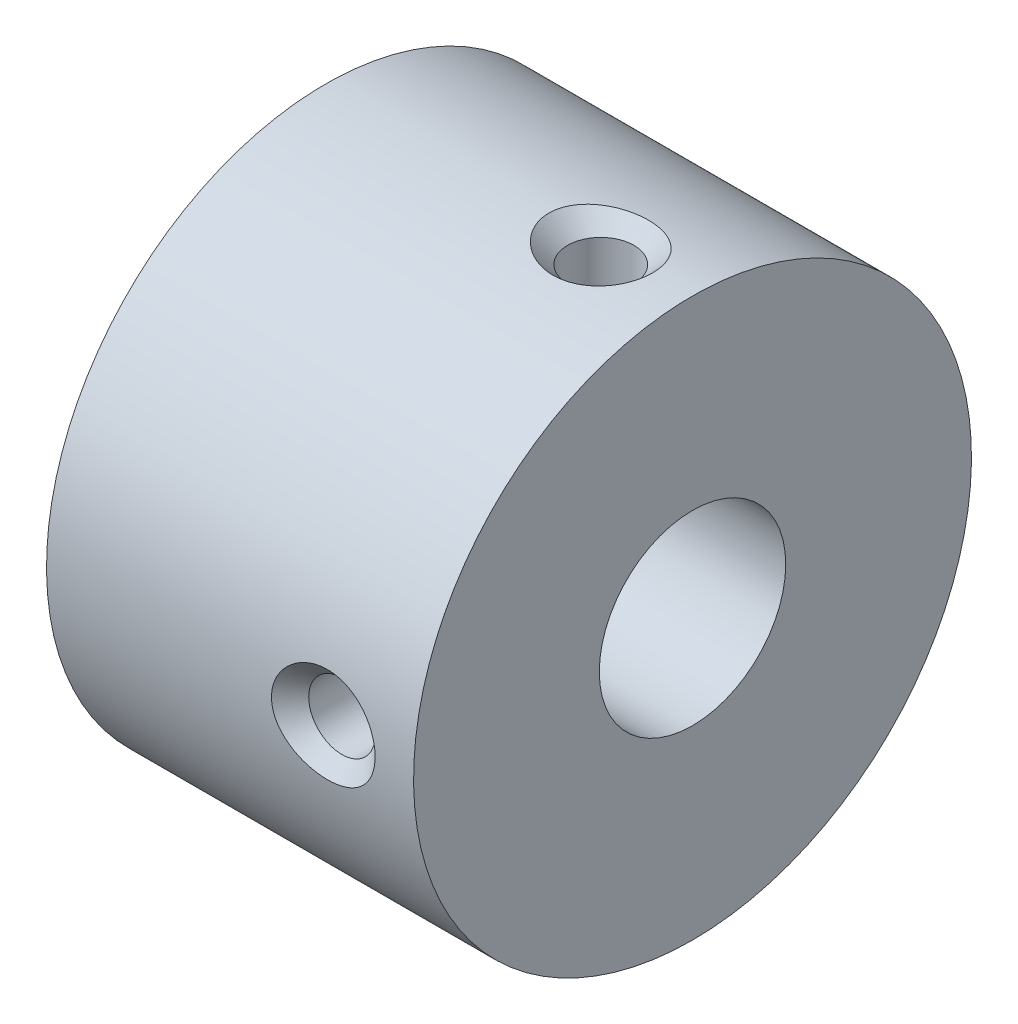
ISO-10303-21;
HEADER;
FILE_DESCRIPTION(('STEP AP214'),'2;1');
FILE_NAME('part.step','',(''),(''),'','','');
FILE_SCHEMA(('AUTOMOTIVE_DESIGN { 1 0 10303 214 1 1 1 1 }'));
ENDSEC;
DATA;
#1=APPLICATION_CONTEXT('core data for automotive mechanical design processes');
#2=APPLICATION_PROTOCOL_DEFINITION('international standard','automotive_design',2000,#1);
#3=PRODUCT_CONTEXT('',#1,'mechanical');
#4=PRODUCT('Part','Part','',(#3));
#5=PRODUCT_RELATED_PRODUCT_CATEGORY('part','',(#4));
#6=PRODUCT_DEFINITION_FORMATION('','',#4);
#7=PRODUCT_DEFINITION_CONTEXT('part definition',#1,'design');
#8=PRODUCT_DEFINITION('design','',#6,#7);
#9=PRODUCT_DEFINITION_SHAPE('','',#8);
#10=(LENGTH_UNIT() NAMED_UNIT(*) SI_UNIT(.MILLI.,.METRE.));
#11=(NAMED_UNIT(*) PLANE_ANGLE_UNIT() SI_UNIT($,.RADIAN.));
#12=(NAMED_UNIT(*) SI_UNIT($,.STERADIAN.) SOLID_ANGLE_UNIT());
#13=UNCERTAINTY_MEASURE_WITH_UNIT(LENGTH_MEASURE(1.E-05),#10,'distance_accuracy_value','');
#14=(GEOMETRIC_REPRESENTATION_CONTEXT(3) GLOBAL_UNCERTAINTY_ASSIGNED_CONTEXT((#13)) GLOBAL_UNIT_ASSIGNED_CONTEXT((#10,
#11,#12)) REPRESENTATION_CONTEXT('',''));
#15=CARTESIAN_POINT('',(0.,0.,0.));
#16=DIRECTION('',(0.,0.,1.));
#17=DIRECTION('',(1.,0.,0.));
#18=AXIS2_PLACEMENT_3D('',#15,#16,#17);
#19=CARTESIAN_POINT('',(-6.25,9.5,0.));
#20=DIRECTION('',(1.,0.,0.));
#21=DIRECTION('',(0.,1.,0.));
#22=AXIS2_PLACEMENT_3D('',#19,#20,#21);
#23=PLANE('',#22);
#24=CARTESIAN_POINT('',(-6.25,0.,0.));
#25=DIRECTION('',(1.,0.,0.));
#26=DIRECTION('',(0.,0.,-1.));
#27=AXIS2_PLACEMENT_3D('',#24,#25,#26);
#28=CIRCLE('',#27,3.175);
#29=CARTESIAN_POINT('',(-6.25,0.,-3.175));
#30=VERTEX_POINT('',#29);
#31=EDGE_CURVE('E96',#30,#30,#28,.T.);
#32=ORIENTED_EDGE('',*,*,#31,.T.);
#33=EDGE_LOOP('',(#32));
#34=FACE_BOUND('',#33,.T.);
#35=CARTESIAN_POINT('',(-6.25,0.,0.));
#36=DIRECTION('',(-1.,0.,0.));
#37=DIRECTION('',(0.,-1.,0.));
#38=AXIS2_PLACEMENT_3D('',#35,#36,#37);
#39=CIRCLE('',#38,9.5);
#40=CARTESIAN_POINT('',(-6.24999999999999,-9.49999999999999,0.));
#41=VERTEX_POINT('',#40);
#42=EDGE_CURVE('E53',#41,#41,#39,.T.);
#43=ORIENTED_EDGE('',*,*,#42,.T.);
#44=EDGE_LOOP('',(#43));
#45=FACE_BOUND('',#44,.T.);
#46=ADVANCED_FACE('F34',(#34,#45),#23,.F.);
#47=CARTESIAN_POINT('',(6.25,9.5,0.));
#48=DIRECTION('',(-1.,0.,0.));
#49=DIRECTION('',(0.,-1.,0.));
#50=AXIS2_PLACEMENT_3D('',#47,#48,#49);
#51=PLANE('',#50);
#52=CARTESIAN_POINT('',(6.25,0.,0.));
#53=DIRECTION('',(1.,0.,0.));
#54=DIRECTION('',(0.,0.,-1.));
#55=AXIS2_PLACEMENT_3D('',#52,#53,#54);
#56=CIRCLE('',#55,3.175);
#57=CARTESIAN_POINT('',(6.25,0.,-3.175));
#58=VERTEX_POINT('',#57);
#59=EDGE_CURVE('E101',#58,#58,#56,.T.);
#60=ORIENTED_EDGE('',*,*,#59,.F.);
#61=EDGE_LOOP('',(#60));
#62=FACE_BOUND('',#61,.T.);
#63=CARTESIAN_POINT('',(6.25,0.,0.));
#64=DIRECTION('',(-1.,0.,0.));
#65=DIRECTION('',(0.,-1.,0.));
#66=AXIS2_PLACEMENT_3D('',#63,#64,#65);
#67=CIRCLE('',#66,9.49999999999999);
#68=CARTESIAN_POINT('',(6.25,-9.49999999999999,0.));
#69=VERTEX_POINT('',#68);
#70=EDGE_CURVE('E48',#69,#69,#67,.T.);
#71=ORIENTED_EDGE('',*,*,#70,.F.);
#72=EDGE_LOOP('',(#71));
#73=FACE_BOUND('',#72,.T.);
#74=ADVANCED_FACE('F84',(#62,#73),#51,.F.);
#75=CARTESIAN_POINT('',(-27.9821883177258,0.,0.));
#76=DIRECTION('',(-1.,0.,0.));
#77=DIRECTION('',(0.,-1.,0.));
#78=AXIS2_PLACEMENT_3D('',#75,#76,#77);
#79=CYLINDRICAL_SURFACE('',#78,9.49999999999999);
#80=CARTESIAN_POINT('',(1.97115523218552,-1.18727474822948,9.42551742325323));
#81=CARTESIAN_POINT('',(1.90785293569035,-1.13285236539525,9.43237228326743));
#82=CARTESIAN_POINT('',(1.84851417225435,-1.07383295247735,9.4393283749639));
#83=CARTESIAN_POINT('',(1.7393148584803,-0.947500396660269,9.4528449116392));
#84=CARTESIAN_POINT('',(1.68945687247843,-0.880185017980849,9.45940524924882));
#85=CARTESIAN_POINT('',(1.5952540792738,-0.729629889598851,9.4722764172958));
#86=CARTESIAN_POINT('',(1.55237482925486,-0.64545126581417,9.47845382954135));
#87=CARTESIAN_POINT('',(1.48264431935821,-0.470558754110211,9.48874210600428));
#88=CARTESIAN_POINT('',(1.45578939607,-0.379846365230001,9.49285344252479));
#89=CARTESIAN_POINT('',(1.4209682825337,-0.202289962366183,9.49822789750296));
#90=CARTESIAN_POINT('',(1.41166910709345,-0.115712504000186,9.49969162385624));
#91=CARTESIAN_POINT('',(1.4082955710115,0.0577278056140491,9.50021989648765));
#92=CARTESIAN_POINT('',(1.41421574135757,0.144590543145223,9.49928530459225));
#93=CARTESIAN_POINT('',(1.4403853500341,0.312138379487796,9.49522473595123));
#94=CARTESIAN_POINT('',(1.45999451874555,0.392927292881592,9.49219673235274));
#95=CARTESIAN_POINT('',(1.51200734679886,0.550171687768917,9.48438263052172));
#96=CARTESIAN_POINT('',(1.54441224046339,0.626626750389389,9.47959636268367));
#97=CARTESIAN_POINT('',(1.6218714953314,0.775500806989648,9.46859730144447));
#98=CARTESIAN_POINT('',(1.66726048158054,0.847742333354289,9.46234769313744));
#99=CARTESIAN_POINT('',(1.76868034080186,0.984233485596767,9.44912672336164));
#100=CARTESIAN_POINT('',(1.82471440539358,1.04848070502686,9.44215514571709));
#101=CARTESIAN_POINT('',(1.95043074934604,1.17245303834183,9.42759513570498));
#102=CARTESIAN_POINT('',(2.02083212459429,1.2314478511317,9.42000057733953));
#103=CARTESIAN_POINT('',(2.16997461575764,1.33782820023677,9.40548269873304));
#104=CARTESIAN_POINT('',(2.24871868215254,1.385209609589,9.39855961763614));
#105=CARTESIAN_POINT('',(2.41907178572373,1.47092073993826,9.38554355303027));
#106=CARTESIAN_POINT('',(2.51120602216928,1.50822527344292,9.37956103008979));
#107=CARTESIAN_POINT('',(2.70032357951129,1.56780217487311,9.36978709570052));
#108=CARTESIAN_POINT('',(2.79730811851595,1.59007074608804,9.3659962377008));
#109=CARTESIAN_POINT('',(2.9984318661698,1.61991219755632,9.36088312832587));
#110=CARTESIAN_POINT('',(3.10268932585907,1.62671537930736,9.3596902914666));
#111=CARTESIAN_POINT('',(3.3109187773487,1.62324504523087,9.36029254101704));
#112=CARTESIAN_POINT('',(3.41489072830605,1.61296920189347,9.36208803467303));
#113=CARTESIAN_POINT('',(3.62110501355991,1.5752600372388,9.36850710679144));
#114=CARTESIAN_POINT('',(3.7233028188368,1.5475887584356,9.37316988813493));
#115=CARTESIAN_POINT('',(3.92144420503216,1.47538302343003,9.38480552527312));
#116=CARTESIAN_POINT('',(4.01738742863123,1.43084760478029,9.39177851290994));
#117=CARTESIAN_POINT('',(4.19854364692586,1.32659609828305,9.40706467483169));
#118=CARTESIAN_POINT('',(4.28390078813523,1.26712788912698,9.41535522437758));
#119=CARTESIAN_POINT('',(4.44261712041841,1.13390136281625,9.43232523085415));
#120=CARTESIAN_POINT('',(4.5159796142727,1.06014699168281,9.44100457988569));
#121=CARTESIAN_POINT('',(4.64398766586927,0.904634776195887,9.4571343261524));
#122=CARTESIAN_POINT('',(4.69945136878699,0.823556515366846,9.46462632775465));
#123=CARTESIAN_POINT('',(4.79449691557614,0.652445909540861,9.47795577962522));
#124=CARTESIAN_POINT('',(4.83409019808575,0.562420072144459,9.4837944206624));
#125=CARTESIAN_POINT('',(4.89263462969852,0.384557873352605,9.4925935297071));
#126=CARTESIAN_POINT('',(4.91309885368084,0.297229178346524,9.4957624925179));
#127=CARTESIAN_POINT('',(4.93810818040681,0.120277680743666,9.49964979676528));
#128=CARTESIAN_POINT('',(4.94266072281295,0.0306559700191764,9.50036928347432));
#129=CARTESIAN_POINT('',(4.93585975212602,-0.142067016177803,9.49930491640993));
#130=CARTESIAN_POINT('',(4.92552641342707,-0.225211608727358,9.49768160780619));
#131=CARTESIAN_POINT('',(4.89124343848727,-0.388564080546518,9.49240210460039));
#132=CARTESIAN_POINT('',(4.86729406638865,-0.468772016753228,9.48874594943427));
#133=CARTESIAN_POINT('',(4.80665462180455,-0.624485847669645,9.47977501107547));
#134=CARTESIAN_POINT('',(4.76991069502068,-0.69997025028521,9.47445322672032));
#135=CARTESIAN_POINT('',(4.68507863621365,-0.844158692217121,9.46269718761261));
#136=CARTESIAN_POINT('',(4.63698775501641,-0.912861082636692,9.45626266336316));
#137=CARTESIAN_POINT('',(4.52753455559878,-1.0463935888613,9.44244998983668));
#138=CARTESIAN_POINT('',(4.46550994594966,-1.11067654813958,9.43503764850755));
#139=CARTESIAN_POINT('',(4.3322568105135,-1.22887543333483,9.4203726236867));
#140=CARTESIAN_POINT('',(4.26102497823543,-1.28278761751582,9.41311999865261));
#141=CARTESIAN_POINT('',(4.1049560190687,-1.38345009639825,9.39887602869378));
#142=CARTESIAN_POINT('',(4.01947874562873,-1.42921924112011,9.39195772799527));
#143=CARTESIAN_POINT('',(3.84230118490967,-1.50680548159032,9.37982318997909));
#144=CARTESIAN_POINT('',(3.75059915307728,-1.53861864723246,9.37460743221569));
#145=CARTESIAN_POINT('',(3.55755041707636,-1.5892880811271,9.36615570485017));
#146=CARTESIAN_POINT('',(3.45595699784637,-1.60723144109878,9.3630605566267));
#147=CARTESIAN_POINT('',(3.25114603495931,-1.62650328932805,9.35973196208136));
#148=CARTESIAN_POINT('',(3.14792808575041,-1.62782756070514,9.35949924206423));
#149=CARTESIAN_POINT('',(2.94008943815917,-1.61365621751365,9.36195323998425));
#150=CARTESIAN_POINT('',(2.83549801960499,-1.59774000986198,9.36471296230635));
#151=CARTESIAN_POINT('',(2.63054488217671,-1.54870822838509,9.37294600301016));
#152=CARTESIAN_POINT('',(2.53018195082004,-1.51559762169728,9.37841853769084));
#153=CARTESIAN_POINT('',(2.34963941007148,-1.43836772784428,9.39054851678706));
#154=CARTESIAN_POINT('',(2.26855475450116,-1.39631040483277,9.3969499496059));
#155=CARTESIAN_POINT('',(2.11379998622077,-1.30040753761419,9.41070041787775));
#156=CARTESIAN_POINT('',(2.04012509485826,-1.24656966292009,9.41804883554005));
#157=CARTESIAN_POINT('',(1.97115523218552,-1.18727474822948,9.42551742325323));
#158=B_SPLINE_CURVE_WITH_KNOTS('',3,(#80,#81,#82,#83,#84,#85,#86,#87,#88,#89,#90,#91,#92,#93,
#94,#95,#96,#97,#98,#99,#100,#101,#102,#103,#104,#105,#106,#107,#108,#109,#110,#111,#112,#113,
#114,#115,#116,#117,#118,#119,#120,#121,#122,#123,#124,#125,#126,#127,#128,#129,#130,#131,#132,
#133,#134,#135,#136,#137,#138,#139,#140,#141,#142,#143,#144,#145,#146,#147,#148,#149,#150,#151,
#152,#153,#154,#155,#156,#157),.UNSPECIFIED.,.T.,.F.,(4,2,2,2,2,2,2,2,2,2,2,2,2,2,2,2,2,2,2,2,2,
2,2,2,2,2,2,2,2,2,2,2,2,2,2,2,2,2,4),(0.,0.251042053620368,0.502151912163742,0.784613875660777,
1.06701123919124,1.32693751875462,1.58677040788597,1.83520003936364,2.08365364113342,
2.33919820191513,2.59481950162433,2.87014450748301,3.14556721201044,3.44298747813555,
3.74048281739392,4.05248742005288,4.36453454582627,4.68094601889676,4.99737555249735,
5.30886454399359,5.62026762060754,5.91423029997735,6.20798072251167,6.47581279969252,
6.74351963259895,6.99372909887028,7.24393371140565,7.49520446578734,7.74653616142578,
8.01430609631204,8.28217246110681,8.57252550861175,8.86296026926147,9.17118328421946,
9.47948450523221,9.79547989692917,10.1113840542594,10.3850800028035,10.6585982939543),.UNSPECIFIED.);
#159=CARTESIAN_POINT('',(1.97115523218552,-1.18727474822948,9.42551742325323));
#160=VERTEX_POINT('',#159);
#161=EDGE_CURVE('E10',#160,#160,#158,.T.);
#162=ORIENTED_EDGE('',*,*,#161,.T.);
#163=EDGE_LOOP('',(#162));
#164=FACE_BOUND('',#163,.T.);
#165=CARTESIAN_POINT('',(1.92115523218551,9.42551742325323,-1.18727474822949));
#166=CARTESIAN_POINT('',(1.98433678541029,9.41867563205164,-1.24159238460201));
#167=CARTESIAN_POINT('',(2.05147712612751,9.411933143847,-1.29134114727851));
#168=CARTESIAN_POINT('',(2.19212860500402,9.39919339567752,-1.38102078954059));
#169=CARTESIAN_POINT('',(2.26564539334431,9.3931968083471,-1.42094283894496));
#170=CARTESIAN_POINT('',(2.43262089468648,9.38135131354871,-1.49734368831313));
#171=CARTESIAN_POINT('',(2.52714062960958,9.37576819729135,-1.5315644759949));
#172=CARTESIAN_POINT('',(2.72053605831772,9.36696259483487,-1.58452962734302));
#173=CARTESIAN_POINT('',(2.81941358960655,9.36374111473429,-1.60326739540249));
#174=CARTESIAN_POINT('',(3.02301517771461,9.35992905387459,-1.62538188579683));
#175=CARTESIAN_POINT('',(3.12781334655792,9.35945095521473,-1.62810197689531));
#176=CARTESIAN_POINT('',(3.33641745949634,9.36148422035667,-1.61636811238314));
#177=CARTESIAN_POINT('',(3.44022333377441,9.36399579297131,-1.60191295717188));
#178=CARTESIAN_POINT('',(3.64501056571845,9.37175975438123,-1.55584955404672));
#179=CARTESIAN_POINT('',(3.74595094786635,9.37704057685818,-1.52406321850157));
#180=CARTESIAN_POINT('',(3.94085412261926,9.3897317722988,-1.44380733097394));
#181=CARTESIAN_POINT('',(4.0348165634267,9.397142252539,-1.39533693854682));
#182=CARTESIAN_POINT('',(4.21094304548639,9.41302355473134,-1.28377932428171));
#183=CARTESIAN_POINT('',(4.29330332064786,9.4214705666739,-1.22099941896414));
#184=CARTESIAN_POINT('',(4.44540822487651,9.4384826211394,-1.08164379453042));
#185=CARTESIAN_POINT('',(4.51515717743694,9.44704762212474,-1.00507282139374));
#186=CARTESIAN_POINT('',(4.63525566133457,9.46265157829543,-0.845144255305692));
#187=CARTESIAN_POINT('',(4.68653255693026,9.46975190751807,-0.76249082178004));
#188=CARTESIAN_POINT('',(4.77298423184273,9.48211863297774,-0.589027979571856));
#189=CARTESIAN_POINT('',(4.80817078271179,9.48738636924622,-0.498224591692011));
#190=CARTESIAN_POINT('',(4.85825766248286,9.49499806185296,-0.319790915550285));
#191=CARTESIAN_POINT('',(4.8746846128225,9.49756048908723,-0.232597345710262));
#192=CARTESIAN_POINT('',(4.89183756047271,9.50023766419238,-0.0566522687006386));
#193=CARTESIAN_POINT('',(4.89256993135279,9.50035340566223,0.0320985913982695));
#194=CARTESIAN_POINT('',(4.87873153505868,9.49819129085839,0.203112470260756));
#195=CARTESIAN_POINT('',(4.86505304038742,9.49605299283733,0.285451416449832));
#196=CARTESIAN_POINT('',(4.8243769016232,9.48983605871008,0.446680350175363));
#197=CARTESIAN_POINT('',(4.79737898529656,9.48575738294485,0.525570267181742));
#198=CARTESIAN_POINT('',(4.7307232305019,9.47602562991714,0.678915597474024));
#199=CARTESIAN_POINT('',(4.69090372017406,9.47035257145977,0.75329913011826));
#200=CARTESIAN_POINT('',(4.6001707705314,9.45802791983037,0.894854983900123));
#201=CARTESIAN_POINT('',(4.54925439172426,9.45137606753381,0.962025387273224));
#202=CARTESIAN_POINT('',(4.43400384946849,9.43723622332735,1.09232274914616));
#203=CARTESIAN_POINT('',(4.36897882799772,9.42972231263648,1.15483516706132));
#204=CARTESIAN_POINT('',(4.23001821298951,9.41503211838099,1.26905229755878));
#205=CARTESIAN_POINT('',(4.15607942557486,9.40785595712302,1.32075311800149));
#206=CARTESIAN_POINT('',(3.99479241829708,9.39395990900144,1.41635052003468));
#207=CARTESIAN_POINT('',(3.90684054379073,9.38732738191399,1.45924266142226));
#208=CARTESIAN_POINT('',(3.72517701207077,9.37594470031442,1.53067719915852));
#209=CARTESIAN_POINT('',(3.63146373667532,9.37119507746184,1.55921554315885));
#210=CARTESIAN_POINT('',(3.43521918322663,9.36386344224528,1.60268021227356));
#211=CARTESIAN_POINT('',(3.33248965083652,9.36142026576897,1.6167388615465));
#212=CARTESIAN_POINT('',(3.12607652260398,9.35946040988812,1.62804568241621));
#213=CARTESIAN_POINT('',(3.0223927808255,9.35994418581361,1.62529123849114));
#214=CARTESIAN_POINT('',(2.8147420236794,9.36382504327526,1.60278341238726));
#215=CARTESIAN_POINT('',(2.71081409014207,9.36728259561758,1.58267715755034));
#216=CARTESIAN_POINT('',(2.50788985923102,9.37678621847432,1.52535828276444));
#217=CARTESIAN_POINT('',(2.40889396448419,9.3828324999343,1.48814426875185));
#218=CARTESIAN_POINT('',(2.21967960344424,9.39672727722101,1.397706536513));
#219=CARTESIAN_POINT('',(2.12939253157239,9.40455970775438,1.34462429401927));
#220=CARTESIAN_POINT('',(1.95963346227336,9.42109697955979,1.2233808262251));
#221=CARTESIAN_POINT('',(1.88015967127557,9.42980167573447,1.15522210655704));
#222=CARTESIAN_POINT('',(1.73845985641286,9.44655406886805,1.00884975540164));
#223=CARTESIAN_POINT('',(1.67560621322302,9.45461353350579,0.931246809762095));
#224=CARTESIAN_POINT('',(1.56522217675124,9.46945520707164,0.765698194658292));
#225=CARTESIAN_POINT('',(1.51768158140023,9.47623826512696,0.677759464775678));
#226=CARTESIAN_POINT('',(1.44358803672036,9.48709856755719,0.502035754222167));
#227=CARTESIAN_POINT('',(1.41559964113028,9.49135619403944,0.414867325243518));
#228=CARTESIAN_POINT('',(1.37584576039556,9.49746375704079,0.23683574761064));
#229=CARTESIAN_POINT('',(1.3640706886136,9.49931511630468,0.145974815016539));
#230=CARTESIAN_POINT('',(1.35760328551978,9.5003286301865,-0.0294277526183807));
#231=CARTESIAN_POINT('',(1.3616816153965,9.49968432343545,-0.113925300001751));
#232=CARTESIAN_POINT('',(1.3840037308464,9.49621128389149,-0.280979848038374));
#233=CARTESIAN_POINT('',(1.40224760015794,9.49338253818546,-0.363536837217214));
#234=CARTESIAN_POINT('',(1.45178444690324,9.48590349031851,-0.523425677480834));
#235=CARTESIAN_POINT('',(1.48291777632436,9.48127551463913,-0.60080844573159));
#236=CARTESIAN_POINT('',(1.55699036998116,9.47067730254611,-0.749556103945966));
#237=CARTESIAN_POINT('',(1.59992623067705,9.4647074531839,-0.820922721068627));
#238=CARTESIAN_POINT('',(1.68723742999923,9.45317530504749,-0.943691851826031));
#239=CARTESIAN_POINT('',(1.72988683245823,9.44774090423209,-0.99634884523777));
#240=CARTESIAN_POINT('',(1.82120756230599,9.43668831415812,-1.09609783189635));
#241=CARTESIAN_POINT('',(1.86987760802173,9.4310701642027,-1.14319100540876));
#242=CARTESIAN_POINT('',(1.92115523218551,9.42551742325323,-1.18727474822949));
#243=B_SPLINE_CURVE_WITH_KNOTS('',3,(#165,#166,#167,#168,#169,#170,#171,#172,#173,#174,#175,
#176,#177,#178,#179,#180,#181,#182,#183,#184,#185,#186,#187,#188,#189,#190,#191,#192,#193,#194,
#195,#196,#197,#198,#199,#200,#201,#202,#203,#204,#205,#206,#207,#208,#209,#210,#211,#212,#213,
#214,#215,#216,#217,#218,#219,#220,#221,#222,#223,#224,#225,#226,#227,#228,#229,#230,#231,#232,
#233,#234,#235,#236,#237,#238,#239,#240,#241,#242),.UNSPECIFIED.,.T.,.F.,(4,2,2,2,2,2,2,2,2,2,2,
2,2,2,2,2,2,2,2,2,2,2,2,2,2,2,2,2,2,2,2,2,2,2,2,2,2,2,4),(0.,0.250623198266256,
0.501470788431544,0.802131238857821,1.10291970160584,1.41595733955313,1.72901684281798,
2.04535555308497,2.36171020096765,2.67182205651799,2.9818273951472,3.27282155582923,
3.56360248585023,3.82850680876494,4.09330355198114,4.34261759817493,4.59193674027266,
4.84453155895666,5.09719336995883,5.36758589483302,5.63807559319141,5.93102454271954,
6.22405615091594,6.53377439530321,6.84354082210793,7.15975931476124,7.47600357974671,
7.78950839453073,8.10296114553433,8.4019195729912,8.70067841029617,8.97415885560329,
9.24747752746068,9.50004071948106,9.7526054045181,10.002131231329,10.2515851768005,
10.4550321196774,10.6584358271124),.UNSPECIFIED.);
#244=CARTESIAN_POINT('',(1.92115523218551,9.42551742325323,-1.18727474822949));
#245=VERTEX_POINT('',#244);
#246=EDGE_CURVE('E44',#245,#245,#243,.T.);
#247=ORIENTED_EDGE('',*,*,#246,.T.);
#248=EDGE_LOOP('',(#247));
#249=FACE_BOUND('',#248,.T.);
#250=ORIENTED_EDGE('',*,*,#42,.F.);
#251=EDGE_LOOP('',(#250));
#252=FACE_BOUND('',#251,.T.);
#253=ORIENTED_EDGE('',*,*,#70,.T.);
#254=EDGE_LOOP('',(#253));
#255=FACE_BOUND('',#254,.T.);
#256=ADVANCED_FACE('F68',(#164,#249,#252,#255),#79,.T.);
#257=CARTESIAN_POINT('',(6.25,0.,0.));
#258=DIRECTION('',(1.,0.,0.));
#259=DIRECTION('',(0.,0.,-1.));
#260=AXIS2_PLACEMENT_3D('',#257,#258,#259);
#261=CYLINDRICAL_SURFACE('',#260,3.175);
#262=CARTESIAN_POINT('',(2.04470000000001,0.,3.175));
#263=CARTESIAN_POINT('',(2.04469877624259,-0.0614285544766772,3.17500087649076));
#264=CARTESIAN_POINT('',(2.04972367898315,-0.122848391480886,3.17320130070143));
#265=CARTESIAN_POINT('',(2.06961858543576,-0.243864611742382,3.16620100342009));
#266=CARTESIAN_POINT('',(2.08448828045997,-0.303461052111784,3.16100038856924));
#267=CARTESIAN_POINT('',(2.12348844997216,-0.419068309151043,3.14775949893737));
#268=CARTESIAN_POINT('',(2.14760216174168,-0.475085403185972,3.13972436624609));
#269=CARTESIAN_POINT('',(2.20432504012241,-0.5822780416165,3.12162393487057));
#270=CARTESIAN_POINT('',(2.23693622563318,-0.633452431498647,3.11155815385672));
#271=CARTESIAN_POINT('',(2.31105507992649,-0.731495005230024,3.09000790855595));
#272=CARTESIAN_POINT('',(2.35283431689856,-0.77814961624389,3.07848610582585));
#273=CARTESIAN_POINT('',(2.44352654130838,-0.863958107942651,3.055516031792));
#274=CARTESIAN_POINT('',(2.4924414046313,-0.903110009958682,3.04406778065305));
#275=CARTESIAN_POINT('',(2.598025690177,-0.974093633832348,3.02211785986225));
#276=CARTESIAN_POINT('',(2.65490051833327,-1.00563502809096,3.01166094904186));
#277=CARTESIAN_POINT('',(2.77357939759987,-1.05861134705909,2.99345244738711));
#278=CARTESIAN_POINT('',(2.8353816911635,-1.08004985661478,2.98569989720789));
#279=CARTESIAN_POINT('',(2.9597149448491,-1.11138819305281,2.9741742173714));
#280=CARTESIAN_POINT('',(3.0221306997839,-1.1216923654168,2.97026214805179));
#281=CARTESIAN_POINT('',(3.14791847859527,-1.13173392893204,2.96645158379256));
#282=CARTESIAN_POINT('',(3.21129014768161,-1.13147514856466,2.96655163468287));
#283=CARTESIAN_POINT('',(3.3336133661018,-1.12070953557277,2.97063328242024));
#284=CARTESIAN_POINT('',(3.39262097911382,-1.1107474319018,2.9744085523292));
#285=CARTESIAN_POINT('',(3.50806464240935,-1.08175290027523,2.98507483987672));
#286=CARTESIAN_POINT('',(3.56450034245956,-1.06271924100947,2.99196628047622));
#287=CARTESIAN_POINT('',(3.67436762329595,-1.01579639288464,3.00822311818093));
#288=CARTESIAN_POINT('',(3.72772847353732,-0.987756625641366,3.01763009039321));
#289=CARTESIAN_POINT('',(3.82915226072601,-0.923722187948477,3.03784253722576));
#290=CARTESIAN_POINT('',(3.87721349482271,-0.887724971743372,3.04864845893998));
#291=CARTESIAN_POINT('',(3.96971122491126,-0.806247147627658,3.0712342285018));
#292=CARTESIAN_POINT('',(4.01375635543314,-0.760326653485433,3.08303358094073));
#293=CARTESIAN_POINT('',(4.09363040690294,-0.661610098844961,3.10571393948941));
#294=CARTESIAN_POINT('',(4.12945830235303,-0.608813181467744,3.11659483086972));
#295=CARTESIAN_POINT('',(4.19225643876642,-0.496923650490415,3.13639217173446));
#296=CARTESIAN_POINT('',(4.21910836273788,-0.437759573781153,3.14528190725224));
#297=CARTESIAN_POINT('',(4.2623520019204,-0.315359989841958,3.15989936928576));
#298=CARTESIAN_POINT('',(4.27874788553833,-0.252126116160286,3.16562835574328));
#299=CARTESIAN_POINT('',(4.2998894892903,-0.126684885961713,3.17306329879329));
#300=CARTESIAN_POINT('',(4.30516304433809,-0.0645771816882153,3.17495136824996));
#301=CARTESIAN_POINT('',(4.30543160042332,0.0596565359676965,3.17504672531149));
#302=CARTESIAN_POINT('',(4.30042861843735,0.121782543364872,3.1732547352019));
#303=CARTESIAN_POINT('',(4.28069555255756,0.242087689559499,3.16631168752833));
#304=CARTESIAN_POINT('',(4.26630097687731,0.300329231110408,3.16127656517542));
#305=CARTESIAN_POINT('',(4.22862458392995,0.413538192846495,3.14846933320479));
#306=CARTESIAN_POINT('',(4.20534161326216,0.468505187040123,3.14069686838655));
#307=CARTESIAN_POINT('',(4.14983109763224,0.575332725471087,3.12292068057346));
#308=CARTESIAN_POINT('',(4.11737039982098,0.627062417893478,3.11286035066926));
#309=CARTESIAN_POINT('',(4.04469392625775,0.724505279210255,3.09163517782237));
#310=CARTESIAN_POINT('',(4.00447550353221,0.770216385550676,3.08046995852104));
#311=CARTESIAN_POINT('',(3.91495158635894,0.856811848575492,3.05754963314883));
#312=CARTESIAN_POINT('',(3.86528162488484,0.897320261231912,3.0457941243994));
#313=CARTESIAN_POINT('',(3.75960588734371,0.969488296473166,3.02359841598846));
#314=CARTESIAN_POINT('',(3.70359981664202,1.00114750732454,3.01315827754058));
#315=CARTESIAN_POINT('',(3.58660726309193,1.05465477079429,2.99485112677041));
#316=CARTESIAN_POINT('',(3.52561638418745,1.07649405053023,2.98698641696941));
#317=CARTESIAN_POINT('',(3.40047036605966,1.10946944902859,2.97489781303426));
#318=CARTESIAN_POINT('',(3.33631694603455,1.12061131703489,2.97067196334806));
#319=CARTESIAN_POINT('',(3.21069434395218,1.1313906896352,2.96658222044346));
#320=CARTESIAN_POINT('',(3.14928675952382,1.13166111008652,2.9664783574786));
#321=CARTESIAN_POINT('',(3.02735111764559,1.12228164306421,2.97003931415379));
#322=CARTESIAN_POINT('',(2.96682299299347,1.1126325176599,2.97370384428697));
#323=CARTESIAN_POINT('',(2.84987294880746,1.08416089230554,2.98419839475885));
#324=CARTESIAN_POINT('',(2.79338646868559,1.06557142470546,2.9909477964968));
#325=CARTESIAN_POINT('',(2.68429540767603,1.01994372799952,3.0068123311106));
#326=CARTESIAN_POINT('',(2.63169176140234,0.992903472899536,3.01592803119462));
#327=CARTESIAN_POINT('',(2.52909051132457,0.929616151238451,3.03604854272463));
#328=CARTESIAN_POINT('',(2.47934295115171,0.892986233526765,3.0471235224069));
#329=CARTESIAN_POINT('',(2.38649729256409,0.812177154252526,3.06964995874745));
#330=CARTESIAN_POINT('',(2.34340120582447,0.767995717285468,3.08110152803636));
#331=CARTESIAN_POINT('',(2.26303642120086,0.670861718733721,3.10373428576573));
#332=CARTESIAN_POINT('',(2.22613466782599,0.61759551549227,3.11487776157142));
#333=CARTESIAN_POINT('',(2.16183451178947,0.50523457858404,3.13506244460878));
#334=CARTESIAN_POINT('',(2.13443530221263,0.446140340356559,3.14410383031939));
#335=CARTESIAN_POINT('',(2.09006649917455,0.323645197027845,3.15906443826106));
#336=CARTESIAN_POINT('',(2.07311543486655,0.260236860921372,3.16497811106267));
#337=CARTESIAN_POINT('',(2.05043499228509,0.131215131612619,3.17294468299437));
#338=CARTESIAN_POINT('',(2.04470130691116,0.0656025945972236,3.17499906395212));
#339=CARTESIAN_POINT('',(2.04470000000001,0.,3.175));
#340=B_SPLINE_CURVE_WITH_KNOTS('',3,(#262,#263,#264,#265,#266,#267,#268,#269,#270,#271,#272,
#273,#274,#275,#276,#277,#278,#279,#280,#281,#282,#283,#284,#285,#286,#287,#288,#289,#290,#291,
#292,#293,#294,#295,#296,#297,#298,#299,#300,#301,#302,#303,#304,#305,#306,#307,#308,#309,#310,
#311,#312,#313,#314,#315,#316,#317,#318,#319,#320,#321,#322,#323,#324,#325,#326,#327,#328,#329,
#330,#331,#332,#333,#334,#335,#336,#337,#338,#339),.UNSPECIFIED.,.T.,.F.,(4,2,2,2,2,2,2,2,2,2,2,
2,2,2,2,2,2,2,2,2,2,2,2,2,2,2,2,2,2,2,2,2,2,2,2,2,2,2,4),(0.,0.184043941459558,
0.368082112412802,0.551788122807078,0.735537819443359,0.925722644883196,1.11595755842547,
1.31258758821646,1.50914779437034,1.69830149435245,1.88738663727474,2.06643452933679,
2.24550673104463,2.42774410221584,2.61003985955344,2.80329006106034,2.99656436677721,
3.19229416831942,3.38794589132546,3.57408187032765,3.76018131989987,3.93997181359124,
4.11978564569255,4.30465683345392,4.48959121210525,4.68416822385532,4.87875428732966,
5.07351384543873,5.26816867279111,5.45147357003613,5.63476438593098,5.81351722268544,
5.9923129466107,6.17977826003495,6.36730015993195,6.56359488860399,6.75987294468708,
6.95649809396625,7.15304773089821),.UNSPECIFIED.);
#341=CARTESIAN_POINT('',(2.04470000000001,0.,3.175));
#342=VERTEX_POINT('',#341);
#343=EDGE_CURVE('E64',#342,#342,#340,.T.);
#344=ORIENTED_EDGE('',*,*,#343,.T.);
#345=EDGE_LOOP('',(#344));
#346=FACE_BOUND('',#345,.T.);
#347=CARTESIAN_POINT('',(3.125,2.96699290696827,-1.13029999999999));
#348=CARTESIAN_POINT('',(3.06371104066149,2.96699180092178,-1.13030126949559));
#349=CARTESIAN_POINT('',(3.00243087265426,2.96891266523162,-1.12529831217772));
#350=CARTESIAN_POINT('',(2.8817032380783,2.976341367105,-1.10549852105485));
#351=CARTESIAN_POINT('',(2.82225587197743,2.9818494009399,-1.09070115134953));
#352=CARTESIAN_POINT('',(2.70696624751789,2.9957511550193,-1.05191211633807));
#353=CARTESIAN_POINT('',(2.65111641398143,3.00413855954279,-1.02794056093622));
#354=CARTESIAN_POINT('',(2.54421075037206,3.02284430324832,-0.971553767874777));
#355=CARTESIAN_POINT('',(2.49315619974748,3.03316315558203,-0.93913628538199));
#356=CARTESIAN_POINT('',(2.39500779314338,3.05508626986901,-0.865225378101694));
#357=CARTESIAN_POINT('',(2.34815910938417,3.06672572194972,-0.823416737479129));
#358=CARTESIAN_POINT('',(2.26196785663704,3.08968323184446,-0.732580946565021));
#359=CARTESIAN_POINT('',(2.22262669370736,3.1010012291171,-0.683552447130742));
#360=CARTESIAN_POINT('',(2.15141872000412,3.1224537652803,-0.577839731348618));
#361=CARTESIAN_POINT('',(2.11981389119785,3.13254217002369,-0.520968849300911));
#362=CARTESIAN_POINT('',(2.066719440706,3.14997980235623,-0.40229583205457));
#363=CARTESIAN_POINT('',(2.04522668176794,3.15732987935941,-0.340495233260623));
#364=CARTESIAN_POINT('',(2.01381290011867,3.16821317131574,-0.216291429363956));
#365=CARTESIAN_POINT('',(2.00347077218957,3.17188488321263,-0.154007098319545));
#366=CARTESIAN_POINT('',(1.99330739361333,3.1754922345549,-0.0284859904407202));
#367=CARTESIAN_POINT('',(1.99348305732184,3.17542896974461,0.0347505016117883));
#368=CARTESIAN_POINT('',(2.00409474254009,3.17166431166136,0.157380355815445));
#369=CARTESIAN_POINT('',(2.01407222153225,3.16812551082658,0.216819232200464));
#370=CARTESIAN_POINT('',(2.04323912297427,3.1580163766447,0.333116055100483));
#371=CARTESIAN_POINT('',(2.06242918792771,3.15144583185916,0.38997382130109));
#372=CARTESIAN_POINT('',(2.10971458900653,3.13581701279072,0.500434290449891));
#373=CARTESIAN_POINT('',(2.13793071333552,3.12672523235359,0.553980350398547));
#374=CARTESIAN_POINT('',(2.20236408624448,3.10698647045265,0.655704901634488));
#375=CARTESIAN_POINT('',(2.23858376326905,3.09633901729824,0.703881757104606));
#376=CARTESIAN_POINT('',(2.3202538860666,3.07392952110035,0.79621570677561));
#377=CARTESIAN_POINT('',(2.36609295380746,3.06213831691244,0.84002250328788));
#378=CARTESIAN_POINT('',(2.46455262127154,3.03923485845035,0.919450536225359));
#379=CARTESIAN_POINT('',(2.51717459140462,3.02812274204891,0.955070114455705));
#380=CARTESIAN_POINT('',(2.62895927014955,3.00766281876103,1.01769271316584));
#381=CARTESIAN_POINT('',(2.68822387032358,2.99835093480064,1.04452651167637));
#382=CARTESIAN_POINT('',(2.81084794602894,2.98296002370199,1.08770687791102));
#383=CARTESIAN_POINT('',(2.87420539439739,2.97687940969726,1.10405859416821));
#384=CARTESIAN_POINT('',(2.99978496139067,2.96900658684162,1.12505332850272));
#385=CARTESIAN_POINT('',(3.06190238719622,2.96701300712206,1.13024679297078));
#386=CARTESIAN_POINT('',(3.1861397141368,2.96697312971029,1.13035235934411));
#387=CARTESIAN_POINT('',(3.24825961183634,2.96892597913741,1.12526668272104));
#388=CARTESIAN_POINT('',(3.36806963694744,2.97635611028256,1.10545550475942));
#389=CARTESIAN_POINT('',(3.42583689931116,2.98168526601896,1.09113471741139));
#390=CARTESIAN_POINT('',(3.53812956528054,2.99509779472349,1.05375787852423));
#391=CARTESIAN_POINT('',(3.59265434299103,3.00318169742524,1.03070014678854));
#392=CARTESIAN_POINT('',(3.69902870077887,3.0215413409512,0.975593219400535));
#393=CARTESIAN_POINT('',(3.75071831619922,3.03188377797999,0.943258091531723));
#394=CARTESIAN_POINT('',(3.84813515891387,3.0534751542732,0.87082753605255));
#395=CARTESIAN_POINT('',(3.8938603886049,3.06472439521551,0.830729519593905));
#396=CARTESIAN_POINT('',(3.98070682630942,3.0876248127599,0.741245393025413));
#397=CARTESIAN_POINT('',(4.02142589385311,3.09926313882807,0.691464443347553));
#398=CARTESIAN_POINT('',(4.09397025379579,3.12101743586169,0.585488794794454));
#399=CARTESIAN_POINT('',(4.12579570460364,3.13113343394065,0.529294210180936));
#400=CARTESIAN_POINT('',(4.17939303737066,3.14867455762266,0.412253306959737));
#401=CARTESIAN_POINT('',(4.20121652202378,3.15611345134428,0.351432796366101));
#402=CARTESIAN_POINT('',(4.23421657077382,3.16751726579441,0.226662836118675));
#403=CARTESIAN_POINT('',(4.24539758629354,3.17148363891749,0.162714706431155));
#404=CARTESIAN_POINT('',(4.25635162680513,3.17537085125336,0.0371588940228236));
#405=CARTESIAN_POINT('',(4.25669853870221,3.17549520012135,-0.024392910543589));
#406=CARTESIAN_POINT('',(4.24742232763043,3.1722011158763,-0.146637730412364));
#407=CARTESIAN_POINT('',(4.23780021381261,3.16878304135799,-0.207330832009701));
#408=CARTESIAN_POINT('',(4.20925332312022,3.1588730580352,-0.324899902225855));
#409=CARTESIAN_POINT('',(4.19052049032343,3.15244466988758,-0.381828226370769));
#410=CARTESIAN_POINT('',(4.14446825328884,3.13717898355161,-0.491747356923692));
#411=CARTESIAN_POINT('',(4.1171472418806,3.12834123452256,-0.544737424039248));
#412=CARTESIAN_POINT('',(4.05344643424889,3.10871467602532,-0.647587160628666));
#413=CARTESIAN_POINT('',(4.01674861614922,3.09786207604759,-0.697237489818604));
#414=CARTESIAN_POINT('',(3.93585525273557,3.07555250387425,-0.789857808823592));
#415=CARTESIAN_POINT('',(3.89165715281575,3.06409532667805,-0.832825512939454));
#416=CARTESIAN_POINT('',(3.79457728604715,3.04122635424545,-0.912898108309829));
#417=CARTESIAN_POINT('',(3.74138813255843,3.0298412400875,-0.949639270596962));
#418=CARTESIAN_POINT('',(3.62922984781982,3.00903053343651,-1.01365584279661));
#419=CARTESIAN_POINT('',(3.57026116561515,2.99960478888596,-1.04093198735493));
#420=CARTESIAN_POINT('',(3.44802364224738,2.9839099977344,-1.08510912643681));
#421=CARTESIAN_POINT('',(3.38474775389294,2.97764627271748,-1.10199264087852));
#422=CARTESIAN_POINT('',(3.25597715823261,2.96918932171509,-1.12458464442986));
#423=CARTESIAN_POINT('',(3.19048356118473,2.96699408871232,-1.1302986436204));
#424=CARTESIAN_POINT('',(3.125,2.96699290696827,-1.13029999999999));
#425=B_SPLINE_CURVE_WITH_KNOTS('',3,(#347,#348,#349,#350,#351,#352,#353,#354,#355,#356,#357,
#358,#359,#360,#361,#362,#363,#364,#365,#366,#367,#368,#369,#370,#371,#372,#373,#374,#375,#376,
#377,#378,#379,#380,#381,#382,#383,#384,#385,#386,#387,#388,#389,#390,#391,#392,#393,#394,#395,
#396,#397,#398,#399,#400,#401,#402,#403,#404,#405,#406,#407,#408,#409,#410,#411,#412,#413,#414,
#415,#416,#417,#418,#419,#420,#421,#422,#423,#424),.UNSPECIFIED.,.T.,.F.,(4,2,2,2,2,2,2,2,2,2,2,
2,2,2,2,2,2,2,2,2,2,2,2,2,2,2,2,2,2,2,2,2,2,2,2,2,2,2,4),(0.,0.183623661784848,
0.367257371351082,0.550490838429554,0.733773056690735,0.924501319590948,1.11526526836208,
1.31179756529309,1.50826884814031,1.69702812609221,1.88573202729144,2.06600906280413,
2.24629867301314,2.4291096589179,2.61197618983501,2.80457310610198,2.99720899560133,
3.19336255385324,3.38941969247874,3.57555921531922,3.76165851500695,3.94011049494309,
4.11859681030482,4.30331748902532,4.48809987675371,4.6832475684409,4.87839178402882,
5.07251754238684,5.26656206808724,5.45030949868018,5.6340383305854,5.8140538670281,
5.99410311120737,6.1813381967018,6.36863718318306,6.56461137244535,6.76057034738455,
6.95685802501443,7.15304884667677),.UNSPECIFIED.);
#426=CARTESIAN_POINT('',(3.125,2.96699290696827,-1.13029999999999));
#427=VERTEX_POINT('',#426);
#428=EDGE_CURVE('E59',#427,#427,#425,.T.);
#429=ORIENTED_EDGE('',*,*,#428,.T.);
#430=EDGE_LOOP('',(#429));
#431=FACE_BOUND('',#430,.T.);
#432=ORIENTED_EDGE('',*,*,#31,.F.);
#433=EDGE_LOOP('',(#432));
#434=FACE_BOUND('',#433,.T.);
#435=ORIENTED_EDGE('',*,*,#59,.T.);
#436=EDGE_LOOP('',(#435));
#437=FACE_BOUND('',#436,.T.);
#438=ADVANCED_FACE('F74',(#346,#431,#434,#437),#261,.F.);
#439=CARTESIAN_POINT('',(3.125,8.865,0.));
#440=DIRECTION('',(0.,1.,0.));
#441=DIRECTION('',(0.,0.,1.));
#442=AXIS2_PLACEMENT_3D('',#439,#440,#441);
#443=CONICAL_SURFACE('',#442,1.13029999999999,0.785398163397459);
#444=CARTESIAN_POINT('',(3.125,8.865,0.));
#445=DIRECTION('',(0.,-1.,0.));
#446=DIRECTION('',(0.,0.,-1.));
#447=AXIS2_PLACEMENT_3D('',#444,#445,#446);
#448=CIRCLE('',#447,1.13029999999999);
#449=CARTESIAN_POINT('',(3.125,8.865,-1.13029999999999));
#450=VERTEX_POINT('',#449);
#451=EDGE_CURVE('E106',#450,#450,#448,.T.);
#452=ORIENTED_EDGE('',*,*,#451,.T.);
#453=EDGE_LOOP('',(#452));
#454=FACE_BOUND('',#453,.T.);
#455=ORIENTED_EDGE('',*,*,#246,.F.);
#456=EDGE_LOOP('',(#455));
#457=FACE_BOUND('',#456,.T.);
#458=ADVANCED_FACE('F70',(#454,#457),#443,.F.);
#459=CARTESIAN_POINT('',(3.125,0.,0.));
#460=DIRECTION('',(0.,-1.,0.));
#461=DIRECTION('',(0.,0.,-1.));
#462=AXIS2_PLACEMENT_3D('',#459,#460,#461);
#463=CYLINDRICAL_SURFACE('',#462,1.13029999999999);
#464=ORIENTED_EDGE('',*,*,#451,.F.);
#465=EDGE_LOOP('',(#464));
#466=FACE_BOUND('',#465,.T.);
#467=ORIENTED_EDGE('',*,*,#428,.F.);
#468=EDGE_LOOP('',(#467));
#469=FACE_BOUND('',#468,.T.);
#470=ADVANCED_FACE('F73',(#466,#469),#463,.F.);
#471=CARTESIAN_POINT('',(3.175,0.,8.865));
#472=DIRECTION('',(0.,0.,1.));
#473=DIRECTION('',(1.,0.,0.));
#474=AXIS2_PLACEMENT_3D('',#471,#472,#473);
#475=CONICAL_SURFACE('',#474,1.13029999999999,0.785398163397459);
#476=CARTESIAN_POINT('',(3.175,0.,8.865));
#477=DIRECTION('',(0.,0.,-1.));
#478=DIRECTION('',(-1.,0.,0.));
#479=AXIS2_PLACEMENT_3D('',#476,#477,#478);
#480=CIRCLE('',#479,1.13029999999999);
#481=CARTESIAN_POINT('',(2.04470000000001,0.,8.865));
#482=VERTEX_POINT('',#481);
#483=EDGE_CURVE('E109',#482,#482,#480,.T.);
#484=ORIENTED_EDGE('',*,*,#483,.T.);
#485=EDGE_LOOP('',(#484));
#486=FACE_BOUND('',#485,.T.);
#487=ORIENTED_EDGE('',*,*,#161,.F.);
#488=EDGE_LOOP('',(#487));
#489=FACE_BOUND('',#488,.T.);
#490=ADVANCED_FACE('F117',(#486,#489),#475,.F.);
#491=CARTESIAN_POINT('',(3.175,0.,0.));
#492=DIRECTION('',(0.,0.,-1.));
#493=DIRECTION('',(-1.,0.,0.));
#494=AXIS2_PLACEMENT_3D('',#491,#492,#493);
#495=CYLINDRICAL_SURFACE('',#494,1.13029999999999);
#496=ORIENTED_EDGE('',*,*,#483,.F.);
#497=EDGE_LOOP('',(#496));
#498=FACE_BOUND('',#497,.T.);
#499=ORIENTED_EDGE('',*,*,#343,.F.);
#500=EDGE_LOOP('',(#499));
#501=FACE_BOUND('',#500,.T.);
#502=ADVANCED_FACE('F115',(#498,#501),#495,.F.);
#503=CLOSED_SHELL('',(#46,#74,#256,#438,#458,#470,#490,#502));
#504=MANIFOLD_SOLID_BREP('B2',#503);
#505=ADVANCED_BREP_SHAPE_REPRESENTATION('',(#18,#504),#14);
#506=SHAPE_DEFINITION_REPRESENTATION(#9,#505);
ENDSEC;
END-ISO-10303-21;
